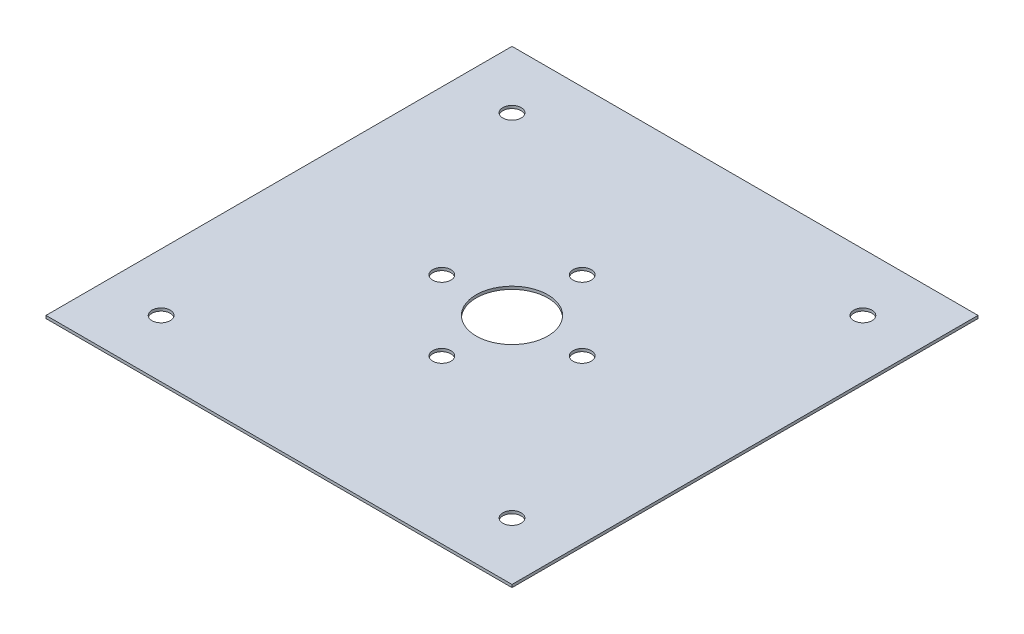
ISO-10303-21;
HEADER;
FILE_DESCRIPTION(('STEP AP214'),'2;1');
FILE_NAME('part.step','',(''),(''),'','','');
FILE_SCHEMA(('AUTOMOTIVE_DESIGN { 1 0 10303 214 1 1 1 1 }'));
ENDSEC;
DATA;
#1=APPLICATION_CONTEXT('core data for automotive mechanical design processes');
#2=APPLICATION_PROTOCOL_DEFINITION('international standard','automotive_design',2000,#1);
#3=PRODUCT_CONTEXT('',#1,'mechanical');
#4=PRODUCT('Part','Part','',(#3));
#5=PRODUCT_RELATED_PRODUCT_CATEGORY('part','',(#4));
#6=PRODUCT_DEFINITION_FORMATION('','',#4);
#7=PRODUCT_DEFINITION_CONTEXT('part definition',#1,'design');
#8=PRODUCT_DEFINITION('design','',#6,#7);
#9=PRODUCT_DEFINITION_SHAPE('','',#8);
#10=(LENGTH_UNIT() NAMED_UNIT(*) SI_UNIT(.MILLI.,.METRE.));
#11=(NAMED_UNIT(*) PLANE_ANGLE_UNIT() SI_UNIT($,.RADIAN.));
#12=(NAMED_UNIT(*) SI_UNIT($,.STERADIAN.) SOLID_ANGLE_UNIT());
#13=UNCERTAINTY_MEASURE_WITH_UNIT(LENGTH_MEASURE(1.E-05),#10,'distance_accuracy_value','');
#14=(GEOMETRIC_REPRESENTATION_CONTEXT(3) GLOBAL_UNCERTAINTY_ASSIGNED_CONTEXT((#13)) GLOBAL_UNIT_ASSIGNED_CONTEXT((#10,
#11,#12)) REPRESENTATION_CONTEXT('',''));
#15=CARTESIAN_POINT('',(0.,0.,0.));
#16=DIRECTION('',(0.,0.,1.));
#17=DIRECTION('',(1.,0.,0.));
#18=AXIS2_PLACEMENT_3D('',#15,#16,#17);
#19=CARTESIAN_POINT('',(0.,2.,0.));
#20=DIRECTION('',(0.,1.,0.));
#21=DIRECTION('',(0.,0.,1.));
#22=AXIS2_PLACEMENT_3D('',#19,#20,#21);
#23=PLANE('',#22);
#24=CARTESIAN_POINT('',(50.,2.,3.21392558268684E-13));
#25=DIRECTION('',(0.,1.,0.));
#26=DIRECTION('',(0.,0.,1.));
#27=AXIS2_PLACEMENT_3D('',#24,#25,#26);
#28=CIRCLE('',#27,6.5);
#29=CARTESIAN_POINT('',(50.,2.,6.50000000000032));
#30=VERTEX_POINT('',#29);
#31=EDGE_CURVE('E150',#30,#30,#28,.T.);
#32=ORIENTED_EDGE('',*,*,#31,.F.);
#33=EDGE_LOOP('',(#32));
#34=FACE_BOUND('',#33,.T.);
#35=CARTESIAN_POINT('',(-50.,2.,0.));
#36=DIRECTION('',(0.,1.,0.));
#37=DIRECTION('',(0.,0.,1.));
#38=AXIS2_PLACEMENT_3D('',#35,#36,#37);
#39=CIRCLE('',#38,6.5);
#40=CARTESIAN_POINT('',(-50.,2.,6.50000000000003));
#41=VERTEX_POINT('',#40);
#42=EDGE_CURVE('E138',#41,#41,#39,.T.);
#43=ORIENTED_EDGE('',*,*,#42,.F.);
#44=EDGE_LOOP('',(#43));
#45=FACE_BOUND('',#44,.T.);
#46=CARTESIAN_POINT('',(-125.,2.,125.));
#47=DIRECTION('',(0.,1.,0.));
#48=DIRECTION('',(0.,0.,-1.));
#49=AXIS2_PLACEMENT_3D('',#46,#47,#48);
#50=CIRCLE('',#49,6.5);
#51=CARTESIAN_POINT('',(-125.,2.,118.5));
#52=VERTEX_POINT('',#51);
#53=EDGE_CURVE('E126',#52,#52,#50,.T.);
#54=ORIENTED_EDGE('',*,*,#53,.F.);
#55=EDGE_LOOP('',(#54));
#56=FACE_BOUND('',#55,.T.);
#57=CARTESIAN_POINT('',(124.999999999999,2.,-125.000000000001));
#58=DIRECTION('',(0.,1.,0.));
#59=DIRECTION('',(0.,0.,-1.));
#60=AXIS2_PLACEMENT_3D('',#57,#58,#59);
#61=CIRCLE('',#60,6.50000000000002);
#62=CARTESIAN_POINT('',(124.999999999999,2.,-131.500000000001));
#63=VERTEX_POINT('',#62);
#64=EDGE_CURVE('E114',#63,#63,#61,.T.);
#65=ORIENTED_EDGE('',*,*,#64,.F.);
#66=EDGE_LOOP('',(#65));
#67=FACE_BOUND('',#66,.T.);
#68=DIRECTION('',(0.,0.,-1.));
#69=VECTOR('',#68,1.);
#70=CARTESIAN_POINT('',(166.,2.,-166.));
#71=LINE('',#70,#69);
#72=CARTESIAN_POINT('',(166.,2.,166.));
#73=VERTEX_POINT('',#72);
#74=CARTESIAN_POINT('',(166.,2.,-166.));
#75=VERTEX_POINT('',#74);
#76=EDGE_CURVE('E84',#73,#75,#71,.T.);
#77=ORIENTED_EDGE('',*,*,#76,.T.);
#78=DIRECTION('',(-1.,0.,0.));
#79=VECTOR('',#78,1.);
#80=CARTESIAN_POINT('',(-166.,2.,-166.));
#81=LINE('',#80,#79);
#82=CARTESIAN_POINT('',(-166.,2.,-166.));
#83=VERTEX_POINT('',#82);
#84=EDGE_CURVE('E79',#75,#83,#81,.T.);
#85=ORIENTED_EDGE('',*,*,#84,.T.);
#86=DIRECTION('',(0.,0.,1.));
#87=VECTOR('',#86,1.);
#88=CARTESIAN_POINT('',(-166.,2.,-166.));
#89=LINE('',#88,#87);
#90=CARTESIAN_POINT('',(-166.,2.,166.));
#91=VERTEX_POINT('',#90);
#92=EDGE_CURVE('E82',#83,#91,#89,.T.);
#93=ORIENTED_EDGE('',*,*,#92,.T.);
#94=DIRECTION('',(1.,0.,0.));
#95=VECTOR('',#94,1.);
#96=CARTESIAN_POINT('',(-166.,2.,166.));
#97=LINE('',#96,#95);
#98=EDGE_CURVE('E49',#91,#73,#97,.T.);
#99=ORIENTED_EDGE('',*,*,#98,.T.);
#100=EDGE_LOOP('',(#77,#85,#93,#99));
#101=FACE_BOUND('',#100,.T.);
#102=CARTESIAN_POINT('',(-125.,2.,-125.));
#103=DIRECTION('',(0.,1.,0.));
#104=DIRECTION('',(0.,0.,1.));
#105=AXIS2_PLACEMENT_3D('',#102,#103,#104);
#106=CIRCLE('',#105,6.5);
#107=CARTESIAN_POINT('',(-125.,2.,-118.5));
#108=VERTEX_POINT('',#107);
#109=EDGE_CURVE('E99',#108,#108,#106,.T.);
#110=ORIENTED_EDGE('',*,*,#109,.F.);
#111=EDGE_LOOP('',(#110));
#112=FACE_BOUND('',#111,.T.);
#113=CARTESIAN_POINT('',(124.999999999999,2.,125.000000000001));
#114=DIRECTION('',(0.,1.,0.));
#115=DIRECTION('',(0.,0.,1.));
#116=AXIS2_PLACEMENT_3D('',#113,#114,#115);
#117=CIRCLE('',#116,6.50000000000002);
#118=CARTESIAN_POINT('',(124.999999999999,2.,131.500000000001));
#119=VERTEX_POINT('',#118);
#120=EDGE_CURVE('E120',#119,#119,#117,.T.);
#121=ORIENTED_EDGE('',*,*,#120,.F.);
#122=EDGE_LOOP('',(#121));
#123=FACE_BOUND('',#122,.T.);
#124=CARTESIAN_POINT('',(0.,2.,0.));
#125=DIRECTION('',(0.,1.,0.));
#126=DIRECTION('',(0.,0.,1.));
#127=AXIS2_PLACEMENT_3D('',#124,#125,#126);
#128=CIRCLE('',#127,25.5);
#129=CARTESIAN_POINT('',(0.,2.,25.5));
#130=VERTEX_POINT('',#129);
#131=EDGE_CURVE('E132',#130,#130,#128,.T.);
#132=ORIENTED_EDGE('',*,*,#131,.F.);
#133=EDGE_LOOP('',(#132));
#134=FACE_BOUND('',#133,.T.);
#135=CARTESIAN_POINT('',(1.46818491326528E-13,2.,-50.));
#136=DIRECTION('',(0.,1.,0.));
#137=DIRECTION('',(0.,0.,1.));
#138=AXIS2_PLACEMENT_3D('',#135,#136,#137);
#139=CIRCLE('',#138,6.5);
#140=CARTESIAN_POINT('',(1.46818491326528E-13,2.,-43.5));
#141=VERTEX_POINT('',#140);
#142=EDGE_CURVE('E144',#141,#141,#139,.T.);
#143=ORIENTED_EDGE('',*,*,#142,.F.);
#144=EDGE_LOOP('',(#143));
#145=FACE_BOUND('',#144,.T.);
#146=CARTESIAN_POINT('',(-4.95966625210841E-13,2.,50.));
#147=DIRECTION('',(0.,1.,0.));
#148=DIRECTION('',(0.,0.,1.));
#149=AXIS2_PLACEMENT_3D('',#146,#147,#148);
#150=CIRCLE('',#149,6.5);
#151=CARTESIAN_POINT('',(-4.95966625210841E-13,2.,56.5));
#152=VERTEX_POINT('',#151);
#153=EDGE_CURVE('E156',#152,#152,#150,.T.);
#154=ORIENTED_EDGE('',*,*,#153,.F.);
#155=EDGE_LOOP('',(#154));
#156=FACE_BOUND('',#155,.T.);
#157=ADVANCED_FACE('F32',(#34,#45,#56,#67,#101,#112,#123,#134,#145,#156),#23,.T.);
#158=CARTESIAN_POINT('',(0.,0.,0.));
#159=DIRECTION('',(0.,1.,0.));
#160=DIRECTION('',(0.,0.,1.));
#161=AXIS2_PLACEMENT_3D('',#158,#159,#160);
#162=PLANE('',#161);
#163=DIRECTION('',(0.,0.,-1.));
#164=VECTOR('',#163,1.);
#165=CARTESIAN_POINT('',(166.,0.,-166.));
#166=LINE('',#165,#164);
#167=CARTESIAN_POINT('',(166.,0.,166.));
#168=VERTEX_POINT('',#167);
#169=CARTESIAN_POINT('',(166.,0.,-166.));
#170=VERTEX_POINT('',#169);
#171=EDGE_CURVE('E96',#168,#170,#166,.T.);
#172=ORIENTED_EDGE('',*,*,#171,.F.);
#173=DIRECTION('',(1.,0.,0.));
#174=VECTOR('',#173,1.);
#175=CARTESIAN_POINT('',(-166.,0.,166.));
#176=LINE('',#175,#174);
#177=CARTESIAN_POINT('',(-166.,0.,166.));
#178=VERTEX_POINT('',#177);
#179=EDGE_CURVE('E72',#178,#168,#176,.T.);
#180=ORIENTED_EDGE('',*,*,#179,.F.);
#181=DIRECTION('',(0.,0.,1.));
#182=VECTOR('',#181,1.);
#183=CARTESIAN_POINT('',(-166.,0.,-166.));
#184=LINE('',#183,#182);
#185=CARTESIAN_POINT('',(-166.,0.,-166.));
#186=VERTEX_POINT('',#185);
#187=EDGE_CURVE('E66',#186,#178,#184,.T.);
#188=ORIENTED_EDGE('',*,*,#187,.F.);
#189=DIRECTION('',(-1.,0.,0.));
#190=VECTOR('',#189,1.);
#191=CARTESIAN_POINT('',(-166.,0.,-166.));
#192=LINE('',#191,#190);
#193=EDGE_CURVE('E88',#170,#186,#192,.T.);
#194=ORIENTED_EDGE('',*,*,#193,.F.);
#195=EDGE_LOOP('',(#172,#180,#188,#194));
#196=FACE_BOUND('',#195,.T.);
#197=CARTESIAN_POINT('',(-125.,0.,-125.));
#198=DIRECTION('',(0.,1.,0.));
#199=DIRECTION('',(0.,0.,1.));
#200=AXIS2_PLACEMENT_3D('',#197,#198,#199);
#201=CIRCLE('',#200,6.5);
#202=CARTESIAN_POINT('',(-125.,0.,-118.5));
#203=VERTEX_POINT('',#202);
#204=EDGE_CURVE('E111',#203,#203,#201,.T.);
#205=ORIENTED_EDGE('',*,*,#204,.T.);
#206=EDGE_LOOP('',(#205));
#207=FACE_BOUND('',#206,.T.);
#208=CARTESIAN_POINT('',(124.999999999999,0.,-125.000000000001));
#209=DIRECTION('',(0.,1.,0.));
#210=DIRECTION('',(0.,0.,-1.));
#211=AXIS2_PLACEMENT_3D('',#208,#209,#210);
#212=CIRCLE('',#211,6.50000000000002);
#213=CARTESIAN_POINT('',(124.999999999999,0.,-131.500000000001));
#214=VERTEX_POINT('',#213);
#215=EDGE_CURVE('E117',#214,#214,#212,.T.);
#216=ORIENTED_EDGE('',*,*,#215,.T.);
#217=EDGE_LOOP('',(#216));
#218=FACE_BOUND('',#217,.T.);
#219=CARTESIAN_POINT('',(124.999999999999,0.,125.000000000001));
#220=DIRECTION('',(0.,1.,0.));
#221=DIRECTION('',(0.,0.,1.));
#222=AXIS2_PLACEMENT_3D('',#219,#220,#221);
#223=CIRCLE('',#222,6.50000000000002);
#224=CARTESIAN_POINT('',(124.999999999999,0.,131.500000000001));
#225=VERTEX_POINT('',#224);
#226=EDGE_CURVE('E123',#225,#225,#223,.T.);
#227=ORIENTED_EDGE('',*,*,#226,.T.);
#228=EDGE_LOOP('',(#227));
#229=FACE_BOUND('',#228,.T.);
#230=CARTESIAN_POINT('',(-125.,0.,125.));
#231=DIRECTION('',(0.,1.,0.));
#232=DIRECTION('',(0.,0.,-1.));
#233=AXIS2_PLACEMENT_3D('',#230,#231,#232);
#234=CIRCLE('',#233,6.5);
#235=CARTESIAN_POINT('',(-125.,0.,118.5));
#236=VERTEX_POINT('',#235);
#237=EDGE_CURVE('E129',#236,#236,#234,.T.);
#238=ORIENTED_EDGE('',*,*,#237,.T.);
#239=EDGE_LOOP('',(#238));
#240=FACE_BOUND('',#239,.T.);
#241=CARTESIAN_POINT('',(0.,0.,0.));
#242=DIRECTION('',(0.,1.,0.));
#243=DIRECTION('',(0.,0.,1.));
#244=AXIS2_PLACEMENT_3D('',#241,#242,#243);
#245=CIRCLE('',#244,25.5);
#246=CARTESIAN_POINT('',(0.,0.,25.5));
#247=VERTEX_POINT('',#246);
#248=EDGE_CURVE('E135',#247,#247,#245,.T.);
#249=ORIENTED_EDGE('',*,*,#248,.T.);
#250=EDGE_LOOP('',(#249));
#251=FACE_BOUND('',#250,.T.);
#252=CARTESIAN_POINT('',(-50.,0.,0.));
#253=DIRECTION('',(0.,1.,0.));
#254=DIRECTION('',(0.,0.,1.));
#255=AXIS2_PLACEMENT_3D('',#252,#253,#254);
#256=CIRCLE('',#255,6.5);
#257=CARTESIAN_POINT('',(-50.,0.,6.50000000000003));
#258=VERTEX_POINT('',#257);
#259=EDGE_CURVE('E141',#258,#258,#256,.T.);
#260=ORIENTED_EDGE('',*,*,#259,.T.);
#261=EDGE_LOOP('',(#260));
#262=FACE_BOUND('',#261,.T.);
#263=CARTESIAN_POINT('',(1.46818491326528E-13,0.,-50.));
#264=DIRECTION('',(0.,1.,0.));
#265=DIRECTION('',(0.,0.,1.));
#266=AXIS2_PLACEMENT_3D('',#263,#264,#265);
#267=CIRCLE('',#266,6.5);
#268=CARTESIAN_POINT('',(1.46818491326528E-13,0.,-43.5));
#269=VERTEX_POINT('',#268);
#270=EDGE_CURVE('E147',#269,#269,#267,.T.);
#271=ORIENTED_EDGE('',*,*,#270,.T.);
#272=EDGE_LOOP('',(#271));
#273=FACE_BOUND('',#272,.T.);
#274=CARTESIAN_POINT('',(50.,0.,3.21392558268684E-13));
#275=DIRECTION('',(0.,1.,0.));
#276=DIRECTION('',(0.,0.,1.));
#277=AXIS2_PLACEMENT_3D('',#274,#275,#276);
#278=CIRCLE('',#277,6.5);
#279=CARTESIAN_POINT('',(50.,0.,6.50000000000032));
#280=VERTEX_POINT('',#279);
#281=EDGE_CURVE('E153',#280,#280,#278,.T.);
#282=ORIENTED_EDGE('',*,*,#281,.T.);
#283=EDGE_LOOP('',(#282));
#284=FACE_BOUND('',#283,.T.);
#285=CARTESIAN_POINT('',(-4.95966625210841E-13,0.,50.));
#286=DIRECTION('',(0.,1.,0.));
#287=DIRECTION('',(0.,0.,1.));
#288=AXIS2_PLACEMENT_3D('',#285,#286,#287);
#289=CIRCLE('',#288,6.5);
#290=CARTESIAN_POINT('',(-4.95966625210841E-13,0.,56.5));
#291=VERTEX_POINT('',#290);
#292=EDGE_CURVE('E159',#291,#291,#289,.T.);
#293=ORIENTED_EDGE('',*,*,#292,.T.);
#294=EDGE_LOOP('',(#293));
#295=FACE_BOUND('',#294,.T.);
#296=ADVANCED_FACE('F107',(#196,#207,#218,#229,#240,#251,#262,#273,#284,#295),#162,.F.);
#297=CARTESIAN_POINT('',(166.,2.,-166.));
#298=DIRECTION('',(-1.,0.,0.));
#299=DIRECTION('',(0.,0.,1.));
#300=AXIS2_PLACEMENT_3D('',#297,#298,#299);
#301=PLANE('',#300);
#302=ORIENTED_EDGE('',*,*,#171,.T.);
#303=DIRECTION('',(0.,-1.,0.));
#304=VECTOR('',#303,1.);
#305=CARTESIAN_POINT('',(166.,2.,-166.));
#306=LINE('',#305,#304);
#307=EDGE_CURVE('E11',#75,#170,#306,.T.);
#308=ORIENTED_EDGE('',*,*,#307,.F.);
#309=ORIENTED_EDGE('',*,*,#76,.F.);
#310=DIRECTION('',(0.,-1.,0.));
#311=VECTOR('',#310,1.);
#312=CARTESIAN_POINT('',(166.,2.,166.));
#313=LINE('',#312,#311);
#314=EDGE_CURVE('E92',#73,#168,#313,.T.);
#315=ORIENTED_EDGE('',*,*,#314,.T.);
#316=EDGE_LOOP('',(#302,#308,#309,#315));
#317=FACE_BOUND('',#316,.T.);
#318=ADVANCED_FACE('F34',(#317),#301,.F.);
#319=CARTESIAN_POINT('',(-166.,2.,-166.));
#320=DIRECTION('',(0.,0.,1.));
#321=DIRECTION('',(1.,0.,0.));
#322=AXIS2_PLACEMENT_3D('',#319,#320,#321);
#323=PLANE('',#322);
#324=ORIENTED_EDGE('',*,*,#193,.T.);
#325=DIRECTION('',(0.,-1.,0.));
#326=VECTOR('',#325,1.);
#327=CARTESIAN_POINT('',(-166.,2.,-166.));
#328=LINE('',#327,#326);
#329=EDGE_CURVE('E41',#83,#186,#328,.T.);
#330=ORIENTED_EDGE('',*,*,#329,.F.);
#331=ORIENTED_EDGE('',*,*,#84,.F.);
#332=ORIENTED_EDGE('',*,*,#307,.T.);
#333=EDGE_LOOP('',(#324,#330,#331,#332));
#334=FACE_BOUND('',#333,.T.);
#335=ADVANCED_FACE('F87',(#334),#323,.F.);
#336=CARTESIAN_POINT('',(-166.,2.,-166.));
#337=DIRECTION('',(1.,0.,0.));
#338=DIRECTION('',(0.,0.,-1.));
#339=AXIS2_PLACEMENT_3D('',#336,#337,#338);
#340=PLANE('',#339);
#341=ORIENTED_EDGE('',*,*,#187,.T.);
#342=DIRECTION('',(0.,-1.,0.));
#343=VECTOR('',#342,1.);
#344=CARTESIAN_POINT('',(-166.,2.,166.));
#345=LINE('',#344,#343);
#346=EDGE_CURVE('E89',#91,#178,#345,.T.);
#347=ORIENTED_EDGE('',*,*,#346,.F.);
#348=ORIENTED_EDGE('',*,*,#92,.F.);
#349=ORIENTED_EDGE('',*,*,#329,.T.);
#350=EDGE_LOOP('',(#341,#347,#348,#349));
#351=FACE_BOUND('',#350,.T.);
#352=ADVANCED_FACE('F90',(#351),#340,.F.);
#353=CARTESIAN_POINT('',(-166.,2.,166.));
#354=DIRECTION('',(0.,0.,-1.));
#355=DIRECTION('',(-1.,0.,0.));
#356=AXIS2_PLACEMENT_3D('',#353,#354,#355);
#357=PLANE('',#356);
#358=ORIENTED_EDGE('',*,*,#179,.T.);
#359=ORIENTED_EDGE('',*,*,#314,.F.);
#360=ORIENTED_EDGE('',*,*,#98,.F.);
#361=ORIENTED_EDGE('',*,*,#346,.T.);
#362=EDGE_LOOP('',(#358,#359,#360,#361));
#363=FACE_BOUND('',#362,.T.);
#364=ADVANCED_FACE('F104',(#363),#357,.F.);
#365=CARTESIAN_POINT('',(-125.,2.,-125.));
#366=DIRECTION('',(0.,-1.,0.));
#367=DIRECTION('',(0.,0.,-1.));
#368=AXIS2_PLACEMENT_3D('',#365,#366,#367);
#369=CYLINDRICAL_SURFACE('',#368,6.5);
#370=ORIENTED_EDGE('',*,*,#109,.T.);
#371=EDGE_LOOP('',(#370));
#372=FACE_BOUND('',#371,.T.);
#373=ORIENTED_EDGE('',*,*,#204,.F.);
#374=EDGE_LOOP('',(#373));
#375=FACE_BOUND('',#374,.T.);
#376=ADVANCED_FACE('F178',(#372,#375),#369,.F.);
#377=CARTESIAN_POINT('',(124.999999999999,2.,-125.000000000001));
#378=DIRECTION('',(0.,-1.,0.));
#379=DIRECTION('',(0.,0.,-1.));
#380=AXIS2_PLACEMENT_3D('',#377,#378,#379);
#381=CYLINDRICAL_SURFACE('',#380,6.50000000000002);
#382=ORIENTED_EDGE('',*,*,#64,.T.);
#383=EDGE_LOOP('',(#382));
#384=FACE_BOUND('',#383,.T.);
#385=ORIENTED_EDGE('',*,*,#215,.F.);
#386=EDGE_LOOP('',(#385));
#387=FACE_BOUND('',#386,.T.);
#388=ADVANCED_FACE('F224',(#384,#387),#381,.F.);
#389=CARTESIAN_POINT('',(124.999999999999,2.,125.000000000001));
#390=DIRECTION('',(0.,-1.,0.));
#391=DIRECTION('',(0.,0.,-1.));
#392=AXIS2_PLACEMENT_3D('',#389,#390,#391);
#393=CYLINDRICAL_SURFACE('',#392,6.50000000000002);
#394=ORIENTED_EDGE('',*,*,#120,.T.);
#395=EDGE_LOOP('',(#394));
#396=FACE_BOUND('',#395,.T.);
#397=ORIENTED_EDGE('',*,*,#226,.F.);
#398=EDGE_LOOP('',(#397));
#399=FACE_BOUND('',#398,.T.);
#400=ADVANCED_FACE('F232',(#396,#399),#393,.F.);
#401=CARTESIAN_POINT('',(-125.,2.,125.));
#402=DIRECTION('',(0.,-1.,0.));
#403=DIRECTION('',(0.,0.,-1.));
#404=AXIS2_PLACEMENT_3D('',#401,#402,#403);
#405=CYLINDRICAL_SURFACE('',#404,6.5);
#406=ORIENTED_EDGE('',*,*,#53,.T.);
#407=EDGE_LOOP('',(#406));
#408=FACE_BOUND('',#407,.T.);
#409=ORIENTED_EDGE('',*,*,#237,.F.);
#410=EDGE_LOOP('',(#409));
#411=FACE_BOUND('',#410,.T.);
#412=ADVANCED_FACE('F240',(#408,#411),#405,.F.);
#413=CARTESIAN_POINT('',(0.,2.,0.));
#414=DIRECTION('',(0.,-1.,0.));
#415=DIRECTION('',(0.,0.,-1.));
#416=AXIS2_PLACEMENT_3D('',#413,#414,#415);
#417=CYLINDRICAL_SURFACE('',#416,25.5);
#418=ORIENTED_EDGE('',*,*,#131,.T.);
#419=EDGE_LOOP('',(#418));
#420=FACE_BOUND('',#419,.T.);
#421=ORIENTED_EDGE('',*,*,#248,.F.);
#422=EDGE_LOOP('',(#421));
#423=FACE_BOUND('',#422,.T.);
#424=ADVANCED_FACE('F249',(#420,#423),#417,.F.);
#425=CARTESIAN_POINT('',(-50.,2.,0.));
#426=DIRECTION('',(0.,-1.,0.));
#427=DIRECTION('',(0.,0.,-1.));
#428=AXIS2_PLACEMENT_3D('',#425,#426,#427);
#429=CYLINDRICAL_SURFACE('',#428,6.5);
#430=ORIENTED_EDGE('',*,*,#42,.T.);
#431=EDGE_LOOP('',(#430));
#432=FACE_BOUND('',#431,.T.);
#433=ORIENTED_EDGE('',*,*,#259,.F.);
#434=EDGE_LOOP('',(#433));
#435=FACE_BOUND('',#434,.T.);
#436=ADVANCED_FACE('F258',(#432,#435),#429,.F.);
#437=CARTESIAN_POINT('',(1.46818491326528E-13,2.,-50.));
#438=DIRECTION('',(0.,-1.,0.));
#439=DIRECTION('',(0.,0.,-1.));
#440=AXIS2_PLACEMENT_3D('',#437,#438,#439);
#441=CYLINDRICAL_SURFACE('',#440,6.5);
#442=ORIENTED_EDGE('',*,*,#142,.T.);
#443=EDGE_LOOP('',(#442));
#444=FACE_BOUND('',#443,.T.);
#445=ORIENTED_EDGE('',*,*,#270,.F.);
#446=EDGE_LOOP('',(#445));
#447=FACE_BOUND('',#446,.T.);
#448=ADVANCED_FACE('F267',(#444,#447),#441,.F.);
#449=CARTESIAN_POINT('',(50.,2.,3.21392558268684E-13));
#450=DIRECTION('',(0.,-1.,0.));
#451=DIRECTION('',(0.,0.,-1.));
#452=AXIS2_PLACEMENT_3D('',#449,#450,#451);
#453=CYLINDRICAL_SURFACE('',#452,6.5);
#454=ORIENTED_EDGE('',*,*,#31,.T.);
#455=EDGE_LOOP('',(#454));
#456=FACE_BOUND('',#455,.T.);
#457=ORIENTED_EDGE('',*,*,#281,.F.);
#458=EDGE_LOOP('',(#457));
#459=FACE_BOUND('',#458,.T.);
#460=ADVANCED_FACE('F276',(#456,#459),#453,.F.);
#461=CARTESIAN_POINT('',(-4.95966625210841E-13,2.,50.));
#462=DIRECTION('',(0.,-1.,0.));
#463=DIRECTION('',(0.,0.,-1.));
#464=AXIS2_PLACEMENT_3D('',#461,#462,#463);
#465=CYLINDRICAL_SURFACE('',#464,6.5);
#466=ORIENTED_EDGE('',*,*,#153,.T.);
#467=EDGE_LOOP('',(#466));
#468=FACE_BOUND('',#467,.T.);
#469=ORIENTED_EDGE('',*,*,#292,.F.);
#470=EDGE_LOOP('',(#469));
#471=FACE_BOUND('',#470,.T.);
#472=ADVANCED_FACE('F165',(#468,#471),#465,.F.);
#473=CLOSED_SHELL('',(#157,#296,#318,#335,#352,#364,#376,#388,#400,#412,#424,#436,#448,#460,#472));
#474=MANIFOLD_SOLID_BREP('B2',#473);
#475=ADVANCED_BREP_SHAPE_REPRESENTATION('',(#18,#474),#14);
#476=SHAPE_DEFINITION_REPRESENTATION(#9,#475);
ENDSEC;
END-ISO-10303-21;
